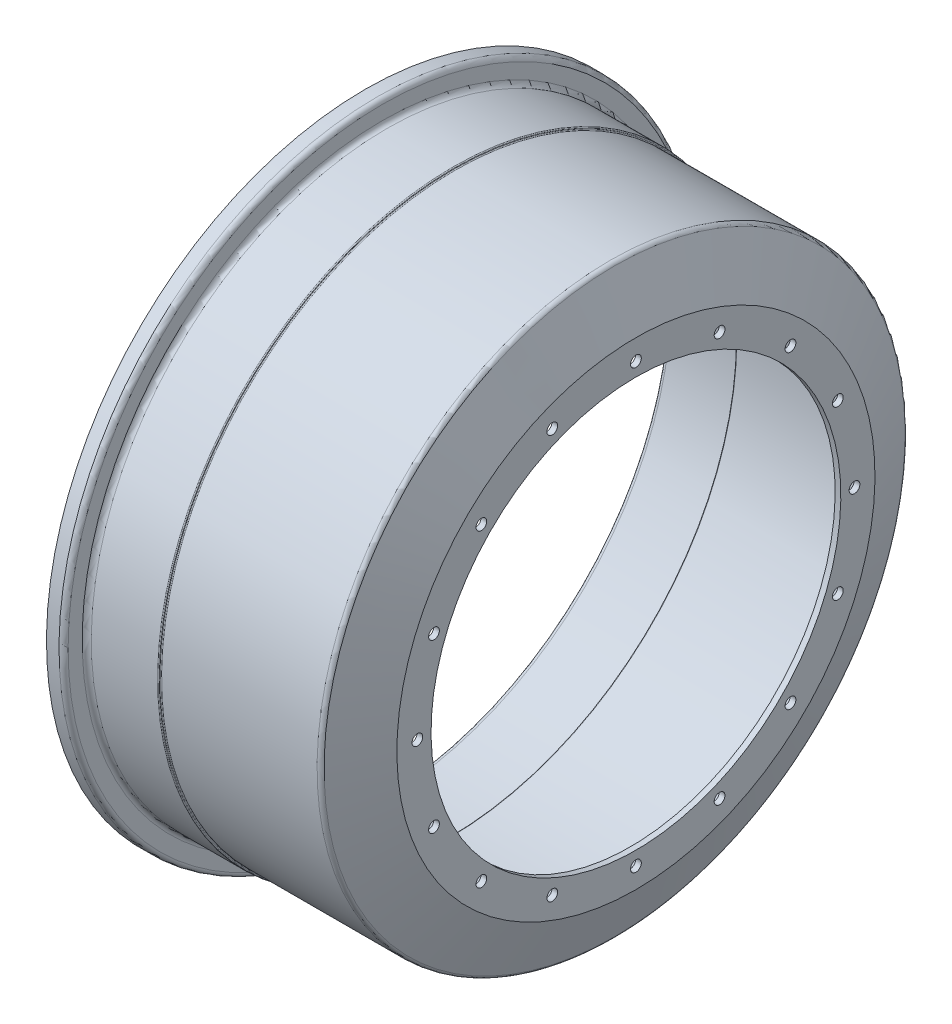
from build123d import *

# Parameters (mm, degrees)
F_6_0_6_DIAMETER_HOLE1_D = 6
CIRPATTERN1_COUNT        = 16


with BuildPart() as part:
    # Sketch2 → Base-Revolve (revolve)
    with BuildSketch(Plane.XY):
        with BuildLine():
            Line((-104.14, 160.4264), (-17.442974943, 160.4264))
            ThreePointArc((-17.442974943, 160.4264), (-16.033091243, 159.999177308), (-15.097486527, 158.86122516))
            Line((-15.097486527, 158.86122516), (-3.175, 130.175))
            Line((-3.175, 130.175), (-3.175, 114.3))
            Line((-3.175, 114.3), (0, 114.3))
            Line((0, 114.3), (0, 133.35))
            Line((0, 133.35), (-11.922486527, 162.03622516))
            ThreePointArc((-11.922486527, 162.03622516), (-12.858091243, 163.174177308), (-14.267974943, 163.6014))
            Line((-14.267974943, 163.6014), (-100.965, 163.6014))
            ThreePointArc((-100.965, 163.6014), (-101.324210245, 163.750189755), (-101.473, 164.1094))
            Line((-101.473, 164.1094), (-101.473, 164.3634))
            ThreePointArc((-101.473, 164.3634), (-101.621789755, 164.722610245), (-101.981, 164.8714))
            Line((-101.981, 164.8714), (-138.938, 164.8714))
            ThreePointArc((-138.938, 164.8714), (-140.734051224, 165.615348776), (-141.478, 167.4114))
            Line((-141.478, 167.4114), (-141.478, 175.26))
            ThreePointArc((-141.478, 175.26), (-142.221948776, 177.056051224), (-144.018, 177.8))
            Line((-144.018, 177.8), (-151.003, 177.8))
            Line((-151.003, 177.8), (-151.003, 174.625))
            Line((-151.003, 174.625), (-147.193, 174.625))
            ThreePointArc((-147.193, 174.625), (-145.396948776, 173.881051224), (-144.653, 172.085))
            Line((-144.653, 172.085), (-144.653, 164.2364))
            ThreePointArc((-144.653, 164.2364), (-143.909051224, 162.440348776), (-142.113, 161.6964))
            Line((-142.113, 161.6964), (-105.156, 161.6964))
            ThreePointArc((-105.156, 161.6964), (-104.796789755, 161.547610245), (-104.648, 161.1884))
            Line((-104.648, 161.1884), (-104.648, 160.9344))
            ThreePointArc((-104.648, 160.9344), (-104.499210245, 160.575189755), (-104.14, 160.4264))
        make_face()
    revolve(axis=Axis((0, 0, 0), (-1, 0, 0)))

    # 6.0 _6_ Diameter Hole1 (through all)
    with Locations(Plane.ZY.offset(3.175)):
        with Locations((0, 121.92)):
            f_6_0_6_diameter_hole1 = Hole(F_6_0_6_DIAMETER_HOLE1_D / 2)

    # CirPattern1: 6.0 _6_ Diameter Hole1 ×16 about axis
    cirpattern1_axis = Axis((0, 0, 0), (1, 0, 0))
    for i in range(1, CIRPATTERN1_COUNT):
        add(f_6_0_6_diameter_hole1.rotate(cirpattern1_axis, i * 360 / CIRPATTERN1_COUNT), mode=Mode.SUBTRACT)


solid = part.part
